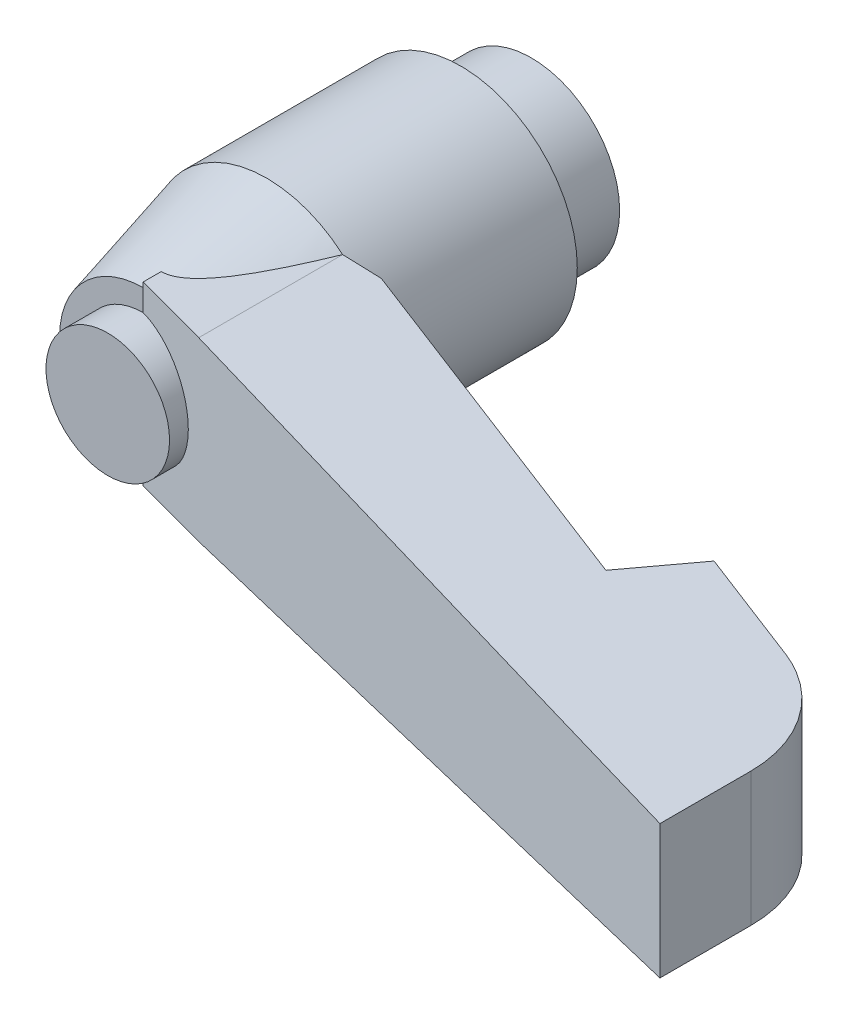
ISO-10303-21;
HEADER;
FILE_DESCRIPTION(('STEP AP214'),'2;1');
FILE_NAME('part.step','',(''),(''),'','','');
FILE_SCHEMA(('AUTOMOTIVE_DESIGN { 1 0 10303 214 1 1 1 1 }'));
ENDSEC;
DATA;
#1=APPLICATION_CONTEXT('core data for automotive mechanical design processes');
#2=APPLICATION_PROTOCOL_DEFINITION('international standard','automotive_design',2000,#1);
#3=PRODUCT_CONTEXT('',#1,'mechanical');
#4=PRODUCT('Part','Part','',(#3));
#5=PRODUCT_RELATED_PRODUCT_CATEGORY('part','',(#4));
#6=PRODUCT_DEFINITION_FORMATION('','',#4);
#7=PRODUCT_DEFINITION_CONTEXT('part definition',#1,'design');
#8=PRODUCT_DEFINITION('design','',#6,#7);
#9=PRODUCT_DEFINITION_SHAPE('','',#8);
#10=(LENGTH_UNIT() NAMED_UNIT(*) SI_UNIT(.MILLI.,.METRE.));
#11=(NAMED_UNIT(*) PLANE_ANGLE_UNIT() SI_UNIT($,.RADIAN.));
#12=(NAMED_UNIT(*) SI_UNIT($,.STERADIAN.) SOLID_ANGLE_UNIT());
#13=UNCERTAINTY_MEASURE_WITH_UNIT(LENGTH_MEASURE(1.E-05),#10,'distance_accuracy_value','');
#14=(GEOMETRIC_REPRESENTATION_CONTEXT(3) GLOBAL_UNCERTAINTY_ASSIGNED_CONTEXT((#13)) GLOBAL_UNIT_ASSIGNED_CONTEXT((#10,
#11,#12)) REPRESENTATION_CONTEXT('',''));
#15=CARTESIAN_POINT('',(0.,0.,0.));
#16=DIRECTION('',(0.,0.,1.));
#17=DIRECTION('',(1.,0.,0.));
#18=AXIS2_PLACEMENT_3D('',#15,#16,#17);
#19=CARTESIAN_POINT('',(-5.06,-5.077411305,0.));
#20=DIRECTION('',(0.,0.,1.));
#21=DIRECTION('',(1.,0.,0.));
#22=AXIS2_PLACEMENT_3D('',#19,#20,#21);
#23=PLANE('',#22);
#24=CARTESIAN_POINT('',(0.,0.,0.));
#25=DIRECTION('',(0.,0.,-1.));
#26=DIRECTION('',(-1.,0.,0.));
#27=AXIS2_PLACEMENT_3D('',#24,#25,#26);
#28=CIRCLE('',#27,2.);
#29=CARTESIAN_POINT('',(-2.,0.,0.));
#30=VERTEX_POINT('',#29);
#31=EDGE_CURVE('E509',#30,#30,#28,.T.);
#32=ORIENTED_EDGE('',*,*,#31,.F.);
#33=EDGE_LOOP('',(#32));
#34=FACE_BOUND('',#33,.T.);
#35=CARTESIAN_POINT('',(0.,0.,0.));
#36=DIRECTION('',(0.,0.,1.));
#37=DIRECTION('',(1.,0.,0.));
#38=AXIS2_PLACEMENT_3D('',#35,#36,#37);
#39=CIRCLE('',#38,5.);
#40=CARTESIAN_POINT('',(5.,0.,0.));
#41=VERTEX_POINT('',#40);
#42=EDGE_CURVE('E18',#41,#41,#39,.T.);
#43=ORIENTED_EDGE('',*,*,#42,.F.);
#44=EDGE_LOOP('',(#43));
#45=FACE_BOUND('',#44,.T.);
#46=ADVANCED_FACE('F14',(#34,#45),#23,.F.);
#47=CARTESIAN_POINT('',(-3.542,-3.554187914,24.));
#48=DIRECTION('',(0.,0.,1.));
#49=DIRECTION('',(1.,0.,0.));
#50=AXIS2_PLACEMENT_3D('',#47,#48,#49);
#51=PLANE('',#50);
#52=CARTESIAN_POINT('',(0.,0.,24.));
#53=DIRECTION('',(0.,0.,1.));
#54=DIRECTION('',(1.,0.,0.));
#55=AXIS2_PLACEMENT_3D('',#52,#53,#54);
#56=CIRCLE('',#55,3.5);
#57=CARTESIAN_POINT('',(3.5,0.,24.));
#58=VERTEX_POINT('',#57);
#59=EDGE_CURVE('E144',#58,#58,#56,.F.);
#60=ORIENTED_EDGE('',*,*,#59,.F.);
#61=EDGE_LOOP('',(#60));
#62=FACE_BOUND('',#61,.T.);
#63=ADVANCED_FACE('F401',(#62),#51,.T.);
#64=CARTESIAN_POINT('',(0.,0.,0.));
#65=DIRECTION('',(0.,0.,1.));
#66=DIRECTION('',(1.,0.,0.));
#67=AXIS2_PLACEMENT_3D('',#64,#65,#66);
#68=CYLINDRICAL_SURFACE('',#67,5.);
#69=CARTESIAN_POINT('',(0.,0.,4.));
#70=DIRECTION('',(0.,0.,1.));
#71=DIRECTION('',(1.,0.,0.));
#72=AXIS2_PLACEMENT_3D('',#69,#70,#71);
#73=CIRCLE('',#72,5.);
#74=CARTESIAN_POINT('',(5.,0.,4.));
#75=VERTEX_POINT('',#74);
#76=EDGE_CURVE('E148',#75,#75,#73,.F.);
#77=ORIENTED_EDGE('',*,*,#76,.T.);
#78=EDGE_LOOP('',(#77));
#79=FACE_BOUND('',#78,.T.);
#80=ORIENTED_EDGE('',*,*,#42,.T.);
#81=EDGE_LOOP('',(#80));
#82=FACE_BOUND('',#81,.T.);
#83=ADVANCED_FACE('F463',(#79,#82),#68,.T.);
#84=CARTESIAN_POINT('',(6.5,1.121419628,15.));
#85=DIRECTION('',(0.,0.,-1.));
#86=DIRECTION('',(-1.,0.,0.));
#87=AXIS2_PLACEMENT_3D('',#84,#85,#86);
#88=PLANE('',#87);
#89=DIRECTION('',(-0.999423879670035,0.0339397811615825,0.));
#90=VECTOR('',#89,1.);
#91=CARTESIAN_POINT('',(22.154065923,4.393963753,15.));
#92=LINE('',#91,#90);
#93=CARTESIAN_POINT('',(6.4999999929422,4.9255655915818,15.));
#94=VERTEX_POINT('',#93);
#95=CARTESIAN_POINT('',(4.30813184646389,4.99999999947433,15.0000000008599));
#96=VERTEX_POINT('',#95);
#97=EDGE_CURVE('E143',#94,#96,#92,.T.);
#98=ORIENTED_EDGE('',*,*,#97,.F.);
#99=DIRECTION('',(0.,1.,0.));
#100=VECTOR('',#99,1.);
#101=CARTESIAN_POINT('',(6.5,0.,15.));
#102=LINE('',#101,#100);
#103=CARTESIAN_POINT('',(6.5,1.14455231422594,15.));
#104=VERTEX_POINT('',#103);
#105=EDGE_CURVE('E293',#104,#94,#102,.T.);
#106=ORIENTED_EDGE('',*,*,#105,.F.);
#107=CARTESIAN_POINT('',(0.,0.,15.));
#108=DIRECTION('',(0.,0.,1.));
#109=DIRECTION('',(1.,0.,0.));
#110=AXIS2_PLACEMENT_3D('',#107,#108,#109);
#111=CIRCLE('',#110,6.6);
#112=EDGE_CURVE('E151',#96,#104,#111,.F.);
#113=ORIENTED_EDGE('',*,*,#112,.F.);
#114=EDGE_LOOP('',(#98,#106,#113));
#115=FACE_BOUND('',#114,.T.);
#116=ADVANCED_FACE('F309',(#115),#88,.T.);
#117=CARTESIAN_POINT('',(33.,3.991671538,27.571700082));
#118=DIRECTION('',(0.,-1.,0.));
#119=DIRECTION('',(0.,0.,-1.));
#120=AXIS2_PLACEMENT_3D('',#117,#118,#119);
#121=CYLINDRICAL_SURFACE('',#120,7.);
#122=CARTESIAN_POINT('',(33.,4.02564292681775,27.571700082));
#123=DIRECTION('',(0.0339397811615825,0.999423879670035,0.));
#124=DIRECTION('',(0.999423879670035,-0.0339397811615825,0.));
#125=AXIS2_PLACEMENT_3D('',#122,#123,#124);
#126=ELLIPSE('',#125,7.00403516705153,7.);
#127=CARTESIAN_POINT('',(40.,3.787927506,27.571700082));
#128=VERTEX_POINT('',#127);
#129=CARTESIAN_POINT('',(35.3941410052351,3.94433946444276,20.9938517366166));
#130=VERTEX_POINT('',#129);
#131=EDGE_CURVE('E117',#128,#130,#126,.T.);
#132=ORIENTED_EDGE('',*,*,#131,.F.);
#133=DIRECTION('',(0.,-1.,0.));
#134=VECTOR('',#133,1.);
#135=CARTESIAN_POINT('',(40.,0.,27.571700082));
#136=LINE('',#135,#134);
#137=CARTESIAN_POINT('',(40.,-3.787927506,27.571700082));
#138=VERTEX_POINT('',#137);
#139=EDGE_CURVE('E108',#128,#138,#136,.T.);
#140=ORIENTED_EDGE('',*,*,#139,.T.);
#141=CARTESIAN_POINT('',(33.,-4.02564292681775,27.571700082));
#142=DIRECTION('',(-0.0339397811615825,0.999423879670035,0.));
#143=DIRECTION('',(-0.999423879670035,-0.0339397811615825,0.));
#144=AXIS2_PLACEMENT_3D('',#141,#142,#143);
#145=ELLIPSE('',#144,7.00403516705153,7.);
#146=CARTESIAN_POINT('',(35.3941410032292,-3.94433946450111,20.9938517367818));
#147=VERTEX_POINT('',#146);
#148=EDGE_CURVE('E120',#138,#147,#145,.T.);
#149=ORIENTED_EDGE('',*,*,#148,.T.);
#150=DIRECTION('',(0.,-1.,0.));
#151=VECTOR('',#150,1.);
#152=CARTESIAN_POINT('',(35.394141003,0.,20.993851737));
#153=LINE('',#152,#151);
#154=EDGE_CURVE('E113',#130,#147,#153,.T.);
#155=ORIENTED_EDGE('',*,*,#154,.F.);
#156=EDGE_LOOP('',(#132,#140,#149,#155));
#157=FACE_BOUND('',#156,.T.);
#158=ADVANCED_FACE('F115',(#157),#121,.T.);
#159=CARTESIAN_POINT('',(35.394141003,-4.210603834,20.993851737));
#160=DIRECTION('',(0.342020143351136,0.,-0.939692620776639));
#161=DIRECTION('',(-0.939692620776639,0.,-0.342020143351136));
#162=AXIS2_PLACEMENT_3D('',#159,#160,#161);
#163=PLANE('',#162);
#164=DIRECTION('',(-0.939214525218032,0.0318951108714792,-0.341846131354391));
#165=VECTOR('',#164,1.);
#166=CARTESIAN_POINT('',(35.3941410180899,3.944339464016,20.9938517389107));
#167=LINE('',#166,#165);
#168=CARTESIAN_POINT('',(29.0236925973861,4.16067572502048,18.67519813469));
#169=VERTEX_POINT('',#168);
#170=EDGE_CURVE('E126',#130,#169,#167,.T.);
#171=ORIENTED_EDGE('',*,*,#170,.F.);
#172=ORIENTED_EDGE('',*,*,#154,.T.);
#173=DIRECTION('',(-0.939214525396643,-0.0318951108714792,-0.341846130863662));
#174=VECTOR('',#173,1.);
#175=CARTESIAN_POINT('',(35.3941410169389,-3.944339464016,20.9938517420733));
#176=LINE('',#175,#174);
#177=CARTESIAN_POINT('',(29.023692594,-4.16067572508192,18.675198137));
#178=VERTEX_POINT('',#177);
#179=EDGE_CURVE('E165',#147,#178,#176,.T.);
#180=ORIENTED_EDGE('',*,*,#179,.T.);
#181=DIRECTION('',(0.,-1.,0.));
#182=VECTOR('',#181,1.);
#183=CARTESIAN_POINT('',(29.023692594,0.,18.675198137));
#184=LINE('',#183,#182);
#185=EDGE_CURVE('E123',#169,#178,#184,.T.);
#186=ORIENTED_EDGE('',*,*,#185,.F.);
#187=EDGE_LOOP('',(#171,#172,#180,#186));
#188=FACE_BOUND('',#187,.T.);
#189=ADVANCED_FACE('F127',(#188),#163,.T.);
#190=CARTESIAN_POINT('',(29.023692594,-4.297335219,18.675198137));
#191=DIRECTION('',(-0.819152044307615,0.,-0.57357643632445));
#192=DIRECTION('',(-0.57357643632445,0.,0.819152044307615));
#193=AXIS2_PLACEMENT_3D('',#190,#191,#192);
#194=PLANE('',#193);
#195=DIRECTION('',(-0.573467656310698,0.0194745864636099,0.818996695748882));
#196=VECTOR('',#195,1.);
#197=CARTESIAN_POINT('',(29.0236925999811,4.16067572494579,18.675198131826));
#198=LINE('',#197,#196);
#199=CARTESIAN_POINT('',(26.5000000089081,4.2463786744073,22.2794046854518));
#200=VERTEX_POINT('',#199);
#201=EDGE_CURVE('E132',#169,#200,#198,.T.);
#202=ORIENTED_EDGE('',*,*,#201,.F.);
#203=ORIENTED_EDGE('',*,*,#185,.T.);
#204=DIRECTION('',(-0.573467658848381,-0.0194745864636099,0.818996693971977));
#205=VECTOR('',#204,1.);
#206=CARTESIAN_POINT('',(29.0236925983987,-4.16067572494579,18.675198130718));
#207=LINE('',#206,#205);
#208=CARTESIAN_POINT('',(26.5,-4.24637867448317,22.279404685));
#209=VERTEX_POINT('',#208);
#210=EDGE_CURVE('E168',#178,#209,#207,.T.);
#211=ORIENTED_EDGE('',*,*,#210,.T.);
#212=DIRECTION('',(0.,-1.,0.));
#213=VECTOR('',#212,1.);
#214=CARTESIAN_POINT('',(26.5,0.,22.279404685));
#215=LINE('',#214,#213);
#216=EDGE_CURVE('E290',#200,#209,#215,.T.);
#217=ORIENTED_EDGE('',*,*,#216,.F.);
#218=EDGE_LOOP('',(#202,#203,#211,#217));
#219=FACE_BOUND('',#218,.T.);
#220=ADVANCED_FACE('F301',(#219),#194,.T.);
#221=CARTESIAN_POINT('',(26.5,-4.984672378,22.279404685));
#222=DIRECTION('',(0.342020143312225,0.,-0.939692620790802));
#223=DIRECTION('',(-0.939692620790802,0.,-0.342020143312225));
#224=AXIS2_PLACEMENT_3D('',#221,#222,#223);
#225=PLANE('',#224);
#226=DIRECTION('',(-0.939214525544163,0.0318951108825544,-0.341846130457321));
#227=VECTOR('',#226,1.);
#228=CARTESIAN_POINT('',(26.5000000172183,4.24637867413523,22.2794046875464));
#229=LINE('',#228,#227);
#230=EDGE_CURVE('E141',#200,#94,#229,.T.);
#231=ORIENTED_EDGE('',*,*,#230,.F.);
#232=ORIENTED_EDGE('',*,*,#216,.T.);
#233=DIRECTION('',(-0.939214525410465,-0.0318951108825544,-0.34184613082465));
#234=VECTOR('',#233,1.);
#235=CARTESIAN_POINT('',(26.5000000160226,-4.24637867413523,22.2794046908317));
#236=LINE('',#235,#234);
#237=CARTESIAN_POINT('',(6.5,-4.92556559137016,15.));
#238=VERTEX_POINT('',#237);
#239=EDGE_CURVE('E170',#209,#238,#236,.T.);
#240=ORIENTED_EDGE('',*,*,#239,.T.);
#241=DIRECTION('',(0.,-1.,0.));
#242=VECTOR('',#241,1.);
#243=CARTESIAN_POINT('',(6.5,-3.072276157,15.));
#244=LINE('',#243,#242);
#245=CARTESIAN_POINT('',(6.50000000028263,-1.1445523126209,15.));
#246=VERTEX_POINT('',#245);
#247=EDGE_CURVE('E163',#246,#238,#244,.T.);
#248=ORIENTED_EDGE('',*,*,#247,.F.);
#249=CARTESIAN_POINT('',(-0.712266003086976,0.,12.3749498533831));
#250=DIRECTION('',(0.342020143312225,0.,-0.939692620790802));
#251=DIRECTION('',(-0.939692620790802,0.,-0.342020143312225));
#252=AXIS2_PLACEMENT_3D('',#249,#250,#251);
#253=ELLIPSE('',#252,7.77209472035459,7.26856501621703);
#254=CARTESIAN_POINT('',(6.59542722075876,-3.94812923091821E-10,15.0145038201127));
#255=VERTEX_POINT('',#254);
#256=EDGE_CURVE('E33',#255,#246,#253,.T.);
#257=ORIENTED_EDGE('',*,*,#256,.F.);
#258=CARTESIAN_POINT('',(0.,0.,12.634193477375));
#259=DIRECTION('',(0.342020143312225,0.,-0.939692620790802));
#260=DIRECTION('',(0.939692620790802,0.,0.342020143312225));
#261=AXIS2_PLACEMENT_3D('',#258,#259,#260);
#262=ELLIPSE('',#261,7.02357329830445,6.6);
#263=EDGE_CURVE('E155',#104,#255,#262,.T.);
#264=ORIENTED_EDGE('',*,*,#263,.F.);
#265=ORIENTED_EDGE('',*,*,#105,.T.);
#266=EDGE_LOOP('',(#231,#232,#240,#248,#257,#264,#265));
#267=FACE_BOUND('',#266,.T.);
#268=ADVANCED_FACE('F306',(#267),#225,.T.);
#269=CARTESIAN_POINT('',(40.,-3.787927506,27.571700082));
#270=DIRECTION('',(-1.,0.,0.));
#271=DIRECTION('',(0.,0.,1.));
#272=AXIS2_PLACEMENT_3D('',#269,#270,#271);
#273=PLANE('',#272);
#274=DIRECTION('',(0.,0.,-1.));
#275=VECTOR('',#274,1.);
#276=CARTESIAN_POINT('',(40.,-3.787927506,23.9121377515));
#277=LINE('',#276,#275);
#278=CARTESIAN_POINT('',(40.,-3.787927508,32.717967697));
#279=VERTEX_POINT('',#278);
#280=EDGE_CURVE('E166',#279,#138,#277,.T.);
#281=ORIENTED_EDGE('',*,*,#280,.T.);
#282=ORIENTED_EDGE('',*,*,#139,.F.);
#283=DIRECTION('',(0.,0.,-1.));
#284=VECTOR('',#283,1.);
#285=CARTESIAN_POINT('',(40.,3.787927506,23.9121377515));
#286=LINE('',#285,#284);
#287=CARTESIAN_POINT('',(40.,3.787927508,32.717967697));
#288=VERTEX_POINT('',#287);
#289=EDGE_CURVE('E137',#288,#128,#286,.T.);
#290=ORIENTED_EDGE('',*,*,#289,.F.);
#291=DIRECTION('',(0.,1.,0.));
#292=VECTOR('',#291,1.);
#293=CARTESIAN_POINT('',(40.,0.,32.717967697));
#294=LINE('',#293,#292);
#295=EDGE_CURVE('E176',#279,#288,#294,.T.);
#296=ORIENTED_EDGE('',*,*,#295,.F.);
#297=EDGE_LOOP('',(#281,#282,#290,#296));
#298=FACE_BOUND('',#297,.T.);
#299=ADVANCED_FACE('F295',(#298),#273,.F.);
#300=CARTESIAN_POINT('',(40.,3.787927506,15.));
#301=DIRECTION('',(0.0339397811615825,0.999423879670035,0.));
#302=DIRECTION('',(-0.999423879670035,0.0339397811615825,0.));
#303=AXIS2_PLACEMENT_3D('',#300,#301,#302);
#304=PLANE('',#303);
#305=ORIENTED_EDGE('',*,*,#230,.T.);
#306=ORIENTED_EDGE('',*,*,#97,.T.);
#307=DIRECTION('',(0.,0.,1.));
#308=VECTOR('',#307,1.);
#309=CARTESIAN_POINT('',(4.308131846,5.,19.0771802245));
#310=LINE('',#309,#308);
#311=CARTESIAN_POINT('',(4.30813184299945,5.,23.1543604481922));
#312=VERTEX_POINT('',#311);
#313=EDGE_CURVE('E152',#96,#312,#310,.T.);
#314=ORIENTED_EDGE('',*,*,#313,.T.);
#315=DIRECTION('',(-0.965406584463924,0.0327845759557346,-0.258679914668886));
#316=VECTOR('',#315,1.);
#317=CARTESIAN_POINT('',(40.,3.78792751,32.717967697));
#318=LINE('',#317,#316);
#319=EDGE_CURVE('E177',#288,#312,#318,.T.);
#320=ORIENTED_EDGE('',*,*,#319,.F.);
#321=ORIENTED_EDGE('',*,*,#289,.T.);
#322=ORIENTED_EDGE('',*,*,#131,.T.);
#323=ORIENTED_EDGE('',*,*,#170,.T.);
#324=ORIENTED_EDGE('',*,*,#201,.T.);
#325=EDGE_LOOP('',(#305,#306,#314,#320,#321,#322,#323,#324));
#326=FACE_BOUND('',#325,.T.);
#327=ADVANCED_FACE('F135',(#326),#304,.T.);
#328=CARTESIAN_POINT('',(0.,0.,22.));
#329=DIRECTION('',(0.,0.,1.));
#330=DIRECTION('',(1.,0.,0.));
#331=AXIS2_PLACEMENT_3D('',#328,#329,#330);
#332=CYLINDRICAL_SURFACE('',#331,3.5);
#333=CARTESIAN_POINT('',(0.,0.,22.));
#334=DIRECTION('',(-0.258819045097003,0.,0.965925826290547));
#335=DIRECTION('',(0.965925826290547,0.,0.258819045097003));
#336=AXIS2_PLACEMENT_3D('',#333,#334,#335);
#337=ELLIPSE('',#336,3.62346663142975,3.5);
#338=CARTESIAN_POINT('',(0.,3.5,22.));
#339=VERTEX_POINT('',#338);
#340=CARTESIAN_POINT('',(0.,-3.5,22.));
#341=VERTEX_POINT('',#340);
#342=EDGE_CURVE('E181',#339,#341,#337,.F.);
#343=ORIENTED_EDGE('',*,*,#342,.F.);
#344=CARTESIAN_POINT('',(0.,0.,22.));
#345=DIRECTION('',(0.,0.,1.));
#346=DIRECTION('',(1.,0.,0.));
#347=AXIS2_PLACEMENT_3D('',#344,#345,#346);
#348=CIRCLE('',#347,3.5);
#349=EDGE_CURVE('E186',#339,#341,#348,.T.);
#350=ORIENTED_EDGE('',*,*,#349,.T.);
#351=EDGE_LOOP('',(#343,#350));
#352=FACE_BOUND('',#351,.T.);
#353=ORIENTED_EDGE('',*,*,#59,.T.);
#354=EDGE_LOOP('',(#353));
#355=FACE_BOUND('',#354,.T.);
#356=ADVANCED_FACE('F412',(#352,#355),#332,.T.);
#357=CARTESIAN_POINT('',(0.,4.722701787,20.96510898));
#358=DIRECTION('',(-1.,0.,0.));
#359=DIRECTION('',(0.,0.,1.));
#360=AXIS2_PLACEMENT_3D('',#357,#358,#359);
#361=PLANE('',#360);
#362=DIRECTION('',(0.,-1.,0.));
#363=VECTOR('',#362,1.);
#364=CARTESIAN_POINT('',(0.,0.,22.));
#365=LINE('',#364,#363);
#366=CARTESIAN_POINT('',(0.,5.,22.00000000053));
#367=VERTEX_POINT('',#366);
#368=CARTESIAN_POINT('',(4.8449077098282E-10,4.7243556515,22.));
#369=VERTEX_POINT('',#368);
#370=EDGE_CURVE('E185',#367,#369,#365,.T.);
#371=ORIENTED_EDGE('',*,*,#370,.F.);
#372=DIRECTION('',(0.,0.,-1.));
#373=VECTOR('',#372,1.);
#374=CARTESIAN_POINT('',(0.,5.,19.0771802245));
#375=LINE('',#374,#373);
#376=CARTESIAN_POINT('',(2.56379285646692E-10,5.,20.9712812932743));
#377=VERTEX_POINT('',#376);
#378=EDGE_CURVE('E147',#367,#377,#375,.T.);
#379=ORIENTED_EDGE('',*,*,#378,.T.);
#380=DIRECTION('',(5.3084673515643E-11,0.258819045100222,-0.965925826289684));
#381=VECTOR('',#380,1.);
#382=CARTESIAN_POINT('',(1.16133208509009E-09,5.6621778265,18.5));
#383=LINE('',#382,#381);
#384=EDGE_CURVE('E199',#369,#377,#383,.T.);
#385=ORIENTED_EDGE('',*,*,#384,.F.);
#386=EDGE_LOOP('',(#371,#379,#385));
#387=FACE_BOUND('',#386,.T.);
#388=ADVANCED_FACE('F259',(#387),#361,.T.);
#389=CARTESIAN_POINT('',(0.,5.,23.203286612));
#390=DIRECTION('',(0.,-1.,0.));
#391=DIRECTION('',(0.,0.,-1.));
#392=AXIS2_PLACEMENT_3D('',#389,#390,#391);
#393=PLANE('',#392);
#394=ORIENTED_EDGE('',*,*,#313,.F.);
#395=CARTESIAN_POINT('',(5.12758570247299E-10,4.99999999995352,20.9712812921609));
#396=CARTESIAN_POINT('',(0.0452169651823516,4.99999999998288,20.9713050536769));
#397=CARTESIAN_POINT('',(0.0904012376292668,4.99999999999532,20.9689904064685));
#398=CARTESIAN_POINT('',(0.180236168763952,5.00000000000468,20.9599070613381));
#399=CARTESIAN_POINT('',(0.224887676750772,5.00000000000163,20.9531468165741));
#400=CARTESIAN_POINT('',(0.355879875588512,4.9999999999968,20.9268621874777));
#401=CARTESIAN_POINT('',(0.441043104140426,4.99999999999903,20.9013147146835));
#402=CARTESIAN_POINT('',(0.632227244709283,5.00000000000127,20.8270446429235));
#403=CARTESIAN_POINT('',(0.736330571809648,5.00000000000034,20.7735488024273));
#404=CARTESIAN_POINT('',(0.935669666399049,4.99999999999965,20.6509465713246));
#405=CARTESIAN_POINT('',(1.03082413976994,4.9999999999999,20.5817135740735));
#406=CARTESIAN_POINT('',(1.23366330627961,5.00000000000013,20.4160087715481));
#407=CARTESIAN_POINT('',(1.33918187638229,5.00000000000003,20.3169366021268));
#408=CARTESIAN_POINT('',(1.54038525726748,4.99999999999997,20.1091453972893));
#409=CARTESIAN_POINT('',(1.63605047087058,4.99999999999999,20.0004079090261));
#410=CARTESIAN_POINT('',(1.82048892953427,5.00000000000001,19.7755785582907));
#411=CARTESIAN_POINT('',(1.9091882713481,5.,19.6594267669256));
#412=CARTESIAN_POINT('',(2.08029219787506,5.,19.4227906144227));
#413=CARTESIAN_POINT('',(2.16270259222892,5.,19.302310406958));
#414=CARTESIAN_POINT('',(2.35274250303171,5.,19.0120714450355));
#415=CARTESIAN_POINT('',(2.4581571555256,5.,18.8408691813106));
#416=CARTESIAN_POINT('',(2.66191601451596,5.,18.494284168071));
#417=CARTESIAN_POINT('',(2.76025796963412,5.,18.3189001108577));
#418=CARTESIAN_POINT('',(2.95155424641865,5.,17.9648132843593));
#419=CARTESIAN_POINT('',(3.04449826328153,5.,17.7861049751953));
#420=CARTESIAN_POINT('',(3.22591068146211,5.,17.4264286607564));
#421=CARTESIAN_POINT('',(3.31437881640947,5.,17.2454605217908));
#422=CARTESIAN_POINT('',(3.48198701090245,5.,16.8936485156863));
#423=CARTESIAN_POINT('',(3.56135902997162,5.,16.7229147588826));
#424=CARTESIAN_POINT('',(3.71739787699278,5.,16.3802085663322));
#425=CARTESIAN_POINT('',(3.79406458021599,5.,16.2082360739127));
#426=CARTESIAN_POINT('',(3.94476452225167,5.,15.8640185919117));
#427=CARTESIAN_POINT('',(4.01880761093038,5.,15.6917779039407));
#428=CARTESIAN_POINT('',(4.16489312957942,5.,15.3464724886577));
#429=CARTESIAN_POINT('',(4.23693578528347,5.,15.1734078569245));
#430=CARTESIAN_POINT('',(4.3081318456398,5.,15.0000000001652));
#431=B_SPLINE_CURVE_WITH_KNOTS('',3,(#395,#396,#397,#398,#399,#400,#401,#402,#403,#404,#405,
#406,#407,#408,#409,#410,#411,#412,#413,#414,#415,#416,#417,#418,#419,#420,#421,#422,#423,#424,
#425,#426,#427,#428,#429,#430),.UNSPECIFIED.,.F.,.F.,(4,2,2,2,2,2,2,2,2,2,2,2,2,2,2,2,2,4),(0.,
0.135533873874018,0.270810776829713,0.536101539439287,0.885260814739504,1.23733529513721,
1.67054898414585,2.10460829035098,2.54278097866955,2.98054386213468,3.58345671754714,
4.18656065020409,4.79078044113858,5.39503614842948,5.95985360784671,6.52469707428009,
7.08712785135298,7.6494949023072),.UNSPECIFIED.);
#432=EDGE_CURVE('E189',#377,#96,#431,.T.);
#433=ORIENTED_EDGE('',*,*,#432,.F.);
#434=ORIENTED_EDGE('',*,*,#378,.F.);
#435=DIRECTION('',(-0.965925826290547,0.,-0.258819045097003));
#436=VECTOR('',#435,1.);
#437=CARTESIAN_POINT('',(20.,5.,27.3589838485));
#438=LINE('',#437,#436);
#439=EDGE_CURVE('E180',#312,#367,#438,.T.);
#440=ORIENTED_EDGE('',*,*,#439,.F.);
#441=EDGE_LOOP('',(#394,#433,#434,#440));
#442=FACE_BOUND('',#441,.T.);
#443=ADVANCED_FACE('F201',(#442),#393,.F.);
#444=CARTESIAN_POINT('',(-6.6792,-6.702182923,4.));
#445=DIRECTION('',(0.,0.,1.));
#446=DIRECTION('',(1.,0.,0.));
#447=AXIS2_PLACEMENT_3D('',#444,#445,#446);
#448=PLANE('',#447);
#449=ORIENTED_EDGE('',*,*,#76,.F.);
#450=EDGE_LOOP('',(#449));
#451=FACE_BOUND('',#450,.T.);
#452=CARTESIAN_POINT('',(0.,0.,4.));
#453=DIRECTION('',(0.,0.,1.));
#454=DIRECTION('',(1.,0.,0.));
#455=AXIS2_PLACEMENT_3D('',#452,#453,#454);
#456=CIRCLE('',#455,6.6);
#457=CARTESIAN_POINT('',(6.6,0.,4.));
#458=VERTEX_POINT('',#457);
#459=EDGE_CURVE('E198',#458,#458,#456,.T.);
#460=ORIENTED_EDGE('',*,*,#459,.F.);
#461=EDGE_LOOP('',(#460));
#462=FACE_BOUND('',#461,.T.);
#463=ADVANCED_FACE('F249',(#451,#462),#448,.F.);
#464=CARTESIAN_POINT('',(0.,0.,15.022195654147));
#465=DIRECTION('',(0.,0.,-1.));
#466=DIRECTION('',(-1.,0.,0.));
#467=AXIS2_PLACEMENT_3D('',#464,#465,#466);
#468=CONICAL_SURFACE('',#467,6.594052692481,0.261799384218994);
#469=CARTESIAN_POINT('',(0.,0.,15.));
#470=DIRECTION('',(0.,0.,1.));
#471=DIRECTION('',(1.,0.,0.));
#472=AXIS2_PLACEMENT_3D('',#469,#470,#471);
#473=CIRCLE('',#472,6.6);
#474=EDGE_CURVE('E266',#255,#246,#473,.F.);
#475=ORIENTED_EDGE('',*,*,#474,.F.);
#476=ORIENTED_EDGE('',*,*,#256,.T.);
#477=EDGE_LOOP('',(#475,#476));
#478=FACE_BOUND('',#477,.T.);
#479=ADVANCED_FACE('F247',(#478),#468,.T.);
#480=CARTESIAN_POINT('',(6.5,-5.023132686,15.));
#481=DIRECTION('',(0.,0.,-1.));
#482=DIRECTION('',(-1.,0.,0.));
#483=AXIS2_PLACEMENT_3D('',#480,#481,#482);
#484=PLANE('',#483);
#485=CARTESIAN_POINT('',(0.,0.,15.));
#486=DIRECTION('',(0.,0.,1.));
#487=DIRECTION('',(1.,0.,0.));
#488=AXIS2_PLACEMENT_3D('',#485,#486,#487);
#489=CIRCLE('',#488,6.6);
#490=CARTESIAN_POINT('',(4.30813184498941,-5.00000000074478,14.9999999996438));
#491=VERTEX_POINT('',#490);
#492=EDGE_CURVE('E268',#246,#491,#489,.F.);
#493=ORIENTED_EDGE('',*,*,#492,.F.);
#494=ORIENTED_EDGE('',*,*,#247,.T.);
#495=DIRECTION('',(-0.999423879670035,-0.0339397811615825,0.));
#496=VECTOR('',#495,1.);
#497=CARTESIAN_POINT('',(22.154065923,-4.393963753,15.));
#498=LINE('',#497,#496);
#499=EDGE_CURVE('E172',#238,#491,#498,.T.);
#500=ORIENTED_EDGE('',*,*,#499,.T.);
#501=EDGE_LOOP('',(#493,#494,#500));
#502=FACE_BOUND('',#501,.T.);
#503=ADVANCED_FACE('F244',(#502),#484,.T.);
#504=CARTESIAN_POINT('',(40.,-3.787927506,15.));
#505=DIRECTION('',(-0.0339397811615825,0.999423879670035,0.));
#506=DIRECTION('',(-0.999423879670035,-0.0339397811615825,0.));
#507=AXIS2_PLACEMENT_3D('',#504,#505,#506);
#508=PLANE('',#507);
#509=DIRECTION('',(0.,0.,1.));
#510=VECTOR('',#509,1.);
#511=CARTESIAN_POINT('',(4.308131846,-5.,19.0771802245));
#512=LINE('',#511,#510);
#513=CARTESIAN_POINT('',(4.30813184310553,-4.99999999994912,23.1543604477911));
#514=VERTEX_POINT('',#513);
#515=EDGE_CURVE('E272',#491,#514,#512,.T.);
#516=ORIENTED_EDGE('',*,*,#515,.F.);
#517=ORIENTED_EDGE('',*,*,#499,.F.);
#518=ORIENTED_EDGE('',*,*,#239,.F.);
#519=ORIENTED_EDGE('',*,*,#210,.F.);
#520=ORIENTED_EDGE('',*,*,#179,.F.);
#521=ORIENTED_EDGE('',*,*,#148,.F.);
#522=ORIENTED_EDGE('',*,*,#280,.F.);
#523=DIRECTION('',(0.965406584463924,0.0327845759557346,0.258679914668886));
#524=VECTOR('',#523,1.);
#525=CARTESIAN_POINT('',(4.30813184,-5.,23.1543604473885));
#526=LINE('',#525,#524);
#527=EDGE_CURVE('E173',#514,#279,#526,.T.);
#528=ORIENTED_EDGE('',*,*,#527,.F.);
#529=EDGE_LOOP('',(#516,#517,#518,#519,#520,#521,#522,#528));
#530=FACE_BOUND('',#529,.T.);
#531=ADVANCED_FACE('F240',(#530),#508,.F.);
#532=CARTESIAN_POINT('',(0.,-5.,22.));
#533=DIRECTION('',(-0.258819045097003,0.,0.965925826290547));
#534=DIRECTION('',(0.965925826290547,0.,0.258819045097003));
#535=AXIS2_PLACEMENT_3D('',#532,#533,#534);
#536=PLANE('',#535);
#537=DIRECTION('',(0.,1.,0.));
#538=VECTOR('',#537,1.);
#539=CARTESIAN_POINT('',(0.,-4.8613508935,22.));
#540=LINE('',#539,#538);
#541=CARTESIAN_POINT('',(0.,-5.,22.0000000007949));
#542=VERTEX_POINT('',#541);
#543=CARTESIAN_POINT('',(9.0870570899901E-10,-4.72435565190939,22.));
#544=VERTEX_POINT('',#543);
#545=EDGE_CURVE('E337',#542,#544,#540,.T.);
#546=ORIENTED_EDGE('',*,*,#545,.F.);
#547=DIRECTION('',(-0.965925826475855,0.,-0.258819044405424));
#548=VECTOR('',#547,1.);
#549=CARTESIAN_POINT('',(4.308131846,-5.,23.1543604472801));
#550=LINE('',#549,#548);
#551=EDGE_CURVE('E331',#514,#542,#550,.T.);
#552=ORIENTED_EDGE('',*,*,#551,.F.);
#553=ORIENTED_EDGE('',*,*,#527,.T.);
#554=ORIENTED_EDGE('',*,*,#295,.T.);
#555=ORIENTED_EDGE('',*,*,#319,.T.);
#556=ORIENTED_EDGE('',*,*,#439,.T.);
#557=ORIENTED_EDGE('',*,*,#370,.T.);
#558=DIRECTION('',(0.,-1.,0.));
#559=VECTOR('',#558,1.);
#560=CARTESIAN_POINT('',(0.,0.,22.));
#561=LINE('',#560,#559);
#562=EDGE_CURVE('E184',#369,#339,#561,.T.);
#563=ORIENTED_EDGE('',*,*,#562,.T.);
#564=ORIENTED_EDGE('',*,*,#342,.T.);
#565=DIRECTION('',(0.,-1.,0.));
#566=VECTOR('',#565,1.);
#567=CARTESIAN_POINT('',(0.,0.,22.));
#568=LINE('',#567,#566);
#569=EDGE_CURVE('E188',#341,#544,#568,.T.);
#570=ORIENTED_EDGE('',*,*,#569,.T.);
#571=EDGE_LOOP('',(#546,#552,#553,#554,#555,#556,#557,#563,#564,#570));
#572=FACE_BOUND('',#571,.T.);
#573=ADVANCED_FACE('F236',(#572),#536,.T.);
#574=CARTESIAN_POINT('',(0.,-4.781047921,22.));
#575=DIRECTION('',(0.,0.,-1.));
#576=DIRECTION('',(-1.,0.,0.));
#577=AXIS2_PLACEMENT_3D('',#574,#575,#576);
#578=PLANE('',#577);
#579=CARTESIAN_POINT('',(0.,0.,22.));
#580=DIRECTION('',(0.,0.,-1.));
#581=DIRECTION('',(-1.,0.,0.));
#582=AXIS2_PLACEMENT_3D('',#579,#580,#581);
#583=CIRCLE('',#582,4.724355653);
#584=EDGE_CURVE('E226',#544,#369,#583,.T.);
#585=ORIENTED_EDGE('',*,*,#584,.F.);
#586=ORIENTED_EDGE('',*,*,#569,.F.);
#587=ORIENTED_EDGE('',*,*,#349,.F.);
#588=ORIENTED_EDGE('',*,*,#562,.F.);
#589=EDGE_LOOP('',(#585,#586,#587,#588));
#590=FACE_BOUND('',#589,.T.);
#591=ADVANCED_FACE('F233',(#590),#578,.F.);
#592=CARTESIAN_POINT('',(0.,0.,4.));
#593=DIRECTION('',(0.,0.,1.));
#594=DIRECTION('',(1.,0.,0.));
#595=AXIS2_PLACEMENT_3D('',#592,#593,#594);
#596=CYLINDRICAL_SURFACE('',#595,6.6);
#597=ORIENTED_EDGE('',*,*,#459,.T.);
#598=EDGE_LOOP('',(#597));
#599=FACE_BOUND('',#598,.T.);
#600=ORIENTED_EDGE('',*,*,#492,.T.);
#601=CARTESIAN_POINT('',(0.,0.,15.));
#602=DIRECTION('',(0.,0.,-1.));
#603=DIRECTION('',(-1.,0.,0.));
#604=AXIS2_PLACEMENT_3D('',#601,#602,#603);
#605=CIRCLE('',#604,6.6);
#606=EDGE_CURVE('E224',#96,#491,#605,.F.);
#607=ORIENTED_EDGE('',*,*,#606,.F.);
#608=ORIENTED_EDGE('',*,*,#112,.T.);
#609=ORIENTED_EDGE('',*,*,#263,.T.);
#610=ORIENTED_EDGE('',*,*,#474,.T.);
#611=EDGE_LOOP('',(#600,#607,#608,#609,#610));
#612=FACE_BOUND('',#611,.T.);
#613=ADVANCED_FACE('F212',(#599,#612),#596,.T.);
#614=CARTESIAN_POINT('',(0.,-5.,23.203286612));
#615=DIRECTION('',(0.,-1.,0.));
#616=DIRECTION('',(0.,0.,-1.));
#617=AXIS2_PLACEMENT_3D('',#614,#615,#616);
#618=PLANE('',#617);
#619=DIRECTION('',(0.,0.,1.));
#620=VECTOR('',#619,1.);
#621=CARTESIAN_POINT('',(0.,-5.,21.48255449));
#622=LINE('',#621,#620);
#623=CARTESIAN_POINT('',(9.61724492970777E-10,-5.,20.9712812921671));
#624=VERTEX_POINT('',#623);
#625=EDGE_CURVE('E335',#624,#542,#622,.T.);
#626=ORIENTED_EDGE('',*,*,#625,.F.);
#627=CARTESIAN_POINT('',(4.30813184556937,-4.99999999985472,15.0000000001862));
#628=CARTESIAN_POINT('',(4.22695317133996,-4.99999999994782,15.1977035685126));
#629=CARTESIAN_POINT('',(4.14468257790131,-4.99999999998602,15.3949657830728));
#630=CARTESIAN_POINT('',(3.97748181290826,-5.00000000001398,15.788403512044));
#631=CARTESIAN_POINT('',(3.89255113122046,-5.00000000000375,15.9845788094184));
#632=CARTESIAN_POINT('',(3.71969315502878,-4.99999999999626,16.3753187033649));
#633=CARTESIAN_POINT('',(3.63176972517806,-4.99999999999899,16.5698850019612));
#634=CARTESIAN_POINT('',(3.45219836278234,-5.00000000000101,16.9572716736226));
#635=CARTESIAN_POINT('',(3.36055072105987,-5.0000000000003,17.1500921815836));
#636=CARTESIAN_POINT('',(3.1396904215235,-4.99999999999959,17.6009656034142));
#637=CARTESIAN_POINT('',(3.00860107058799,-4.99999999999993,17.8581134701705));
#638=CARTESIAN_POINT('',(2.80337635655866,-5.00000000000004,18.23954911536));
#639=CARTESIAN_POINT('',(2.73346011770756,-5.00000000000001,18.3661077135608));
#640=CARTESIAN_POINT('',(2.59024232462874,-4.99999999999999,18.6172895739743));
#641=CARTESIAN_POINT('',(2.51694106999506,-5.,18.7419130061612));
#642=CARTESIAN_POINT('',(2.36662462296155,-5.,18.98807422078));
#643=CARTESIAN_POINT('',(2.28962938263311,-5.,19.1096241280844));
#644=CARTESIAN_POINT('',(2.1306979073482,-5.,19.3494323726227));
#645=CARTESIAN_POINT('',(2.04876288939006,-5.,19.4676915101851));
#646=CARTESIAN_POINT('',(1.87890565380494,-5.,19.6994333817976));
#647=CARTESIAN_POINT('',(1.79099818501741,-5.,19.8129268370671));
#648=CARTESIAN_POINT('',(1.60741923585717,-5.,20.0333897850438));
#649=CARTESIAN_POINT('',(1.51175533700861,-5.,20.1403654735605));
#650=CARTESIAN_POINT('',(1.32832695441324,-5.,20.3262886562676));
#651=CARTESIAN_POINT('',(1.24219801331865,-5.,20.4068316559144));
#652=CARTESIAN_POINT('',(1.06151972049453,-5.,20.5582115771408));
#653=CARTESIAN_POINT('',(0.966967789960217,-5.,20.6290455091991));
#654=CARTESIAN_POINT('',(0.785708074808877,-5.,20.7446890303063));
#655=CARTESIAN_POINT('',(0.700550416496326,-5.,20.7918848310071));
#656=CARTESIAN_POINT('',(0.523922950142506,-5.,20.8719390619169));
#657=CARTESIAN_POINT('',(0.432483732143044,-5.,20.904861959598));
#658=CARTESIAN_POINT('',(0.283565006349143,-5.,20.9424237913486));
#659=CARTESIAN_POINT('',(0.227601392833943,-5.,20.9531268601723));
#660=CARTESIAN_POINT('',(0.114454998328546,-5.,20.9676092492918));
#661=CARTESIAN_POINT('',(0.0572669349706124,-5.,20.9713468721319));
#662=CARTESIAN_POINT('',(9.62542482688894E-10,-5.,20.9712812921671));
#663=B_SPLINE_CURVE_WITH_KNOTS('',3,(#627,#628,#629,#630,#631,#632,#633,#634,#635,#636,#637,
#638,#639,#640,#641,#642,#643,#644,#645,#646,#647,#648,#649,#650,#651,#652,#653,#654,#655,#656,
#657,#658,#659,#660,#661,#662),.UNSPECIFIED.,.F.,.F.,(4,2,2,2,2,2,2,2,2,2,2,2,2,2,2,2,2,4),(0.,
0.641169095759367,1.28246191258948,1.92295587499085,2.56339991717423,3.42905863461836,
3.86277961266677,4.29646227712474,4.72802050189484,5.15947283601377,5.58989593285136,
6.0199032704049,6.3731949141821,6.72659509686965,7.01777107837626,7.30761782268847,
7.478145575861,7.64969092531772),.UNSPECIFIED.);
#664=EDGE_CURVE('E24',#491,#624,#663,.T.);
#665=ORIENTED_EDGE('',*,*,#664,.F.);
#666=ORIENTED_EDGE('',*,*,#515,.T.);
#667=ORIENTED_EDGE('',*,*,#551,.T.);
#668=EDGE_LOOP('',(#626,#665,#666,#667));
#669=FACE_BOUND('',#668,.T.);
#670=ADVANCED_FACE('F228',(#669),#618,.T.);
#671=CARTESIAN_POINT('',(0.,-5.,20.96510898));
#672=DIRECTION('',(-1.,0.,0.));
#673=DIRECTION('',(0.,0.,1.));
#674=AXIS2_PLACEMENT_3D('',#671,#672,#673);
#675=PLANE('',#674);
#676=ORIENTED_EDGE('',*,*,#625,.T.);
#677=ORIENTED_EDGE('',*,*,#545,.T.);
#678=DIRECTION('',(-9.95650459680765E-11,0.258819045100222,0.965925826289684));
#679=VECTOR('',#678,1.);
#680=CARTESIAN_POINT('',(2.17818203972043E-09,-5.6621778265,18.5));
#681=LINE('',#680,#679);
#682=EDGE_CURVE('E9',#624,#544,#681,.T.);
#683=ORIENTED_EDGE('',*,*,#682,.F.);
#684=EDGE_LOOP('',(#676,#677,#683));
#685=FACE_BOUND('',#684,.T.);
#686=ADVANCED_FACE('F16',(#685),#675,.T.);
#687=CARTESIAN_POINT('',(0.,0.,22.));
#688=DIRECTION('',(0.,0.,-1.));
#689=DIRECTION('',(-1.,0.,0.));
#690=AXIS2_PLACEMENT_3D('',#687,#688,#689);
#691=CONICAL_SURFACE('',#690,4.724355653,0.261799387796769);
#692=ORIENTED_EDGE('',*,*,#664,.T.);
#693=ORIENTED_EDGE('',*,*,#682,.T.);
#694=ORIENTED_EDGE('',*,*,#584,.T.);
#695=ORIENTED_EDGE('',*,*,#384,.T.);
#696=ORIENTED_EDGE('',*,*,#432,.T.);
#697=ORIENTED_EDGE('',*,*,#606,.T.);
#698=EDGE_LOOP('',(#692,#693,#694,#695,#696,#697));
#699=FACE_BOUND('',#698,.T.);
#700=ADVANCED_FACE('F205',(#699),#691,.T.);
#701=CARTESIAN_POINT('',(0.,0.,9.));
#702=DIRECTION('',(0.,0.,-1.));
#703=DIRECTION('',(-1.,0.,0.));
#704=AXIS2_PLACEMENT_3D('',#701,#702,#703);
#705=CYLINDRICAL_SURFACE('',#704,2.);
#706=CARTESIAN_POINT('',(0.,0.,9.));
#707=DIRECTION('',(0.,0.,-1.));
#708=DIRECTION('',(-1.,0.,0.));
#709=AXIS2_PLACEMENT_3D('',#706,#707,#708);
#710=CIRCLE('',#709,2.);
#711=CARTESIAN_POINT('',(-2.,0.,9.));
#712=VERTEX_POINT('',#711);
#713=EDGE_CURVE('E507',#712,#712,#710,.T.);
#714=ORIENTED_EDGE('',*,*,#713,.F.);
#715=EDGE_LOOP('',(#714));
#716=FACE_BOUND('',#715,.T.);
#717=ORIENTED_EDGE('',*,*,#31,.T.);
#718=EDGE_LOOP('',(#717));
#719=FACE_BOUND('',#718,.T.);
#720=ADVANCED_FACE('F210',(#716,#719),#705,.F.);
#721=CARTESIAN_POINT('',(0.,0.,9.));
#722=DIRECTION('',(0.,0.,-1.));
#723=DIRECTION('',(-1.,0.,0.));
#724=AXIS2_PLACEMENT_3D('',#721,#722,#723);
#725=PLANE('',#724);
#726=ORIENTED_EDGE('',*,*,#713,.T.);
#727=EDGE_LOOP('',(#726));
#728=FACE_BOUND('',#727,.T.);
#729=ADVANCED_FACE('F380',(#728),#725,.T.);
#730=CLOSED_SHELL('',(#46,#63,#83,#116,#158,#189,#220,#268,#299,#327,#356,#388,#443,#463,#479,
#503,#531,#573,#591,#613,#670,#686,#700,#720,#729));
#731=MANIFOLD_SOLID_BREP('B1',#730);
#732=ADVANCED_BREP_SHAPE_REPRESENTATION('',(#18,#731),#14);
#733=SHAPE_DEFINITION_REPRESENTATION(#9,#732);
ENDSEC;
END-ISO-10303-21;
